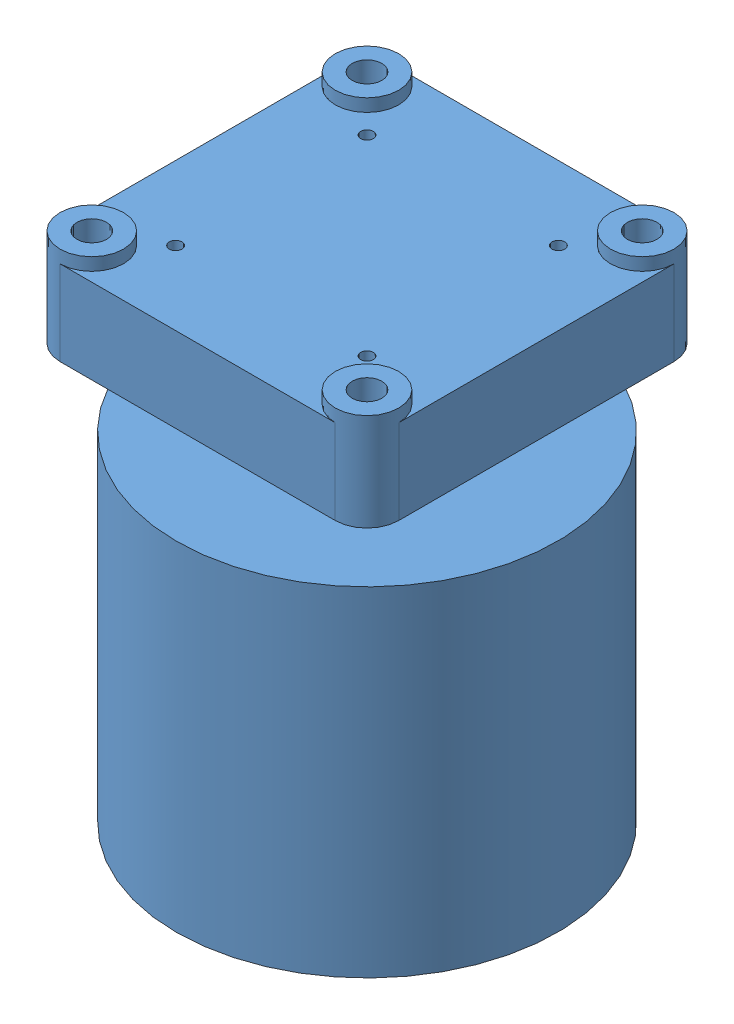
SolidWorks assembly AssemWithBrackets.SLDASM, configuration Default (file format 15000). Lengths in mm.
Overall size (90 136 180).
5 component instances, 3 part files, 12 mates.
Components (placement in the parent):
- bracketGimbal-3: bracketGimbal.SLDPRT [Default] at (-4.2647 -34.9382 23.7279) x (-1 0 0) z (0 0 1) size (21.8 9.45 180)
- gimbalModelApprox-1: gimbalModelApprox.SLDPRT [Default] at (1.0363 -59.4382 23.7279) size (90 121 90)
- bracketGimbal-5: bracketGimbal.SLDPRT [Default] at (6.3374 -34.9382 23.7279) x (1 0 0) z (0 0 -1) size (21.8 9.45 180)
- bracketGimbalwithoutAttach-1: bracketGimbalwithoutAttach.SLDPRT [Default] at (6.3374 -25.9382 23.7279) size (14.8 9 180)
- bracketGimbalwithoutAttach-2: bracketGimbalwithoutAttach.SLDPRT [Default] at (-19.0647 -25.9382 23.7279) size (14.8 9 180)
Mates (geometry in assembly coordinates):
- Coincident9: coincident anti-aligned: plane of bracketGimbal-3 through (-19.0647 -39.4382 113.7279) normal (0 -1 0); plane of gimbalModelApprox-1 through (-31.4637 -39.4382 56.2279) normal (0 1 0)
- Concentric2: concentric anti-aligned: cylinder of bracketGimbal-3 through (-21.5642 -42.9382 46.3284) axis (0 1 0) radius 1.5; cylinder of gimbalModelApprox-1 through (-21.5642 -39.4382 46.3284) axis (0 -1 0) radius 1.5
- Concentric4: concentric anti-aligned: cylinder of bracketGimbal-3 through (-21.5642 -42.9382 1.1274) axis (0 1 0) radius 1.5; cylinder of gimbalModelApprox-1 through (-21.5642 -39.4382 1.1274) axis (0 -1 0) radius 1.5
- Coincident10: coincident anti-aligned: plane of gimbalModelApprox-1 through (-31.4637 -39.4382 56.2279) normal (0 1 0); plane of bracketGimbal-5 through (21.1374 -39.4382 -66.2721) normal (0 -1 0)
- Concentric5: concentric anti-aligned: cylinder of gimbalModelApprox-1 through (23.6369 -39.4382 1.1274) axis (0 -1 0) radius 1.5; cylinder of bracketGimbal-5 through (23.6369 -42.9382 1.1274) axis (0 1 0) radius 1.5
- Concentric6: concentric anti-aligned: line of gimbalModelApprox-1 through (23.6369 -39.4382 46.3284) axis (0 -1 0); axis of bracketGimbal-5 through (23.6369 -39.4382 46.3284) axis (0 1 0)
- Concentric11: concentric anti-aligned: cylinder of bracketGimbal-5 through (13.7374 -30.4382 108.8069) axis (0 -1 0) radius 2; cylinder of bracketGimbalwithoutAttach-1 through (13.7374 -30.4382 108.8069) axis (0 1 0) radius 2
- Coincident15: coincident anti-aligned: plane of bracketGimbal-5 through (21.1374 -30.4382 -66.2721) normal (0 1 0); plane of bracketGimbalwithoutAttach-1 through (21.1374 -30.4382 113.7279) normal (0 -1 0)
- Concentric12: concentric anti-aligned: cylinder of bracketGimbal-5 through (13.7374 -30.4382 -61.3511) axis (0 -1 0) radius 2; cylinder of bracketGimbalwithoutAttach-1 through (13.7374 -30.4382 -61.3511) axis (0 1 0) radius 2
- Coincident16: coincident anti-aligned: plane of bracketGimbal-3 through (-19.0647 -30.4382 113.7279) normal (0 1 0); plane of bracketGimbalwithoutAttach-2 through (-4.2647 -30.4382 113.7279) normal (0 -1 0)
- Concentric13: concentric anti-aligned: cylinder of bracketGimbal-3 through (-11.6647 -30.4382 108.8069) axis (0 -1 0) radius 2; cylinder of bracketGimbalwithoutAttach-2 through (-11.6647 -30.4382 108.8069) axis (0 1 0) radius 2
- Concentric14: concentric anti-aligned: cylinder of bracketGimbal-3 through (-11.6647 -30.4382 -61.3511) axis (0 -1 0) radius 2; cylinder of bracketGimbalwithoutAttach-2 through (-11.6647 -30.4382 -61.3511) axis (0 1 0) radius 2
